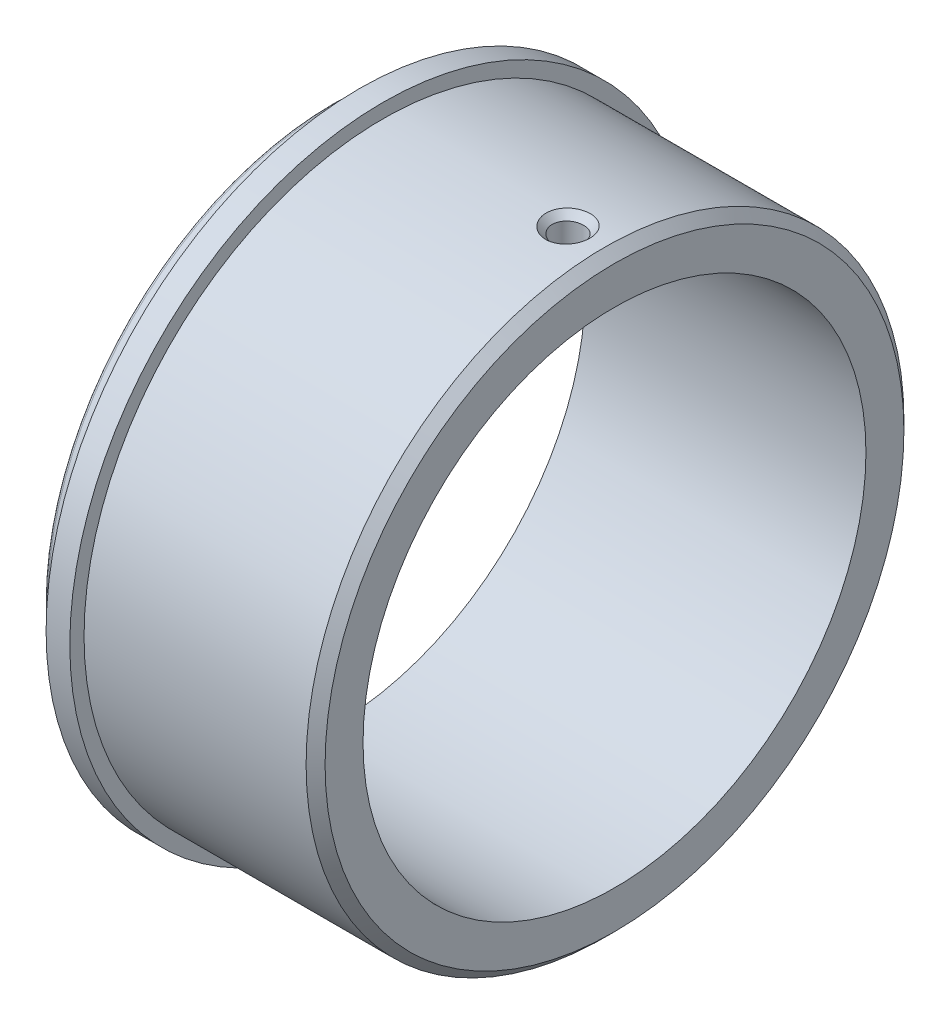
ISO-10303-21;
HEADER;
FILE_DESCRIPTION(('STEP AP214'),'2;1');
FILE_NAME('part.step','',(''),(''),'','','');
FILE_SCHEMA(('AUTOMOTIVE_DESIGN { 1 0 10303 214 1 1 1 1 }'));
ENDSEC;
DATA;
#1=APPLICATION_CONTEXT('core data for automotive mechanical design processes');
#2=APPLICATION_PROTOCOL_DEFINITION('international standard','automotive_design',2000,#1);
#3=PRODUCT_CONTEXT('',#1,'mechanical');
#4=PRODUCT('Part','Part','',(#3));
#5=PRODUCT_RELATED_PRODUCT_CATEGORY('part','',(#4));
#6=PRODUCT_DEFINITION_FORMATION('','',#4);
#7=PRODUCT_DEFINITION_CONTEXT('part definition',#1,'design');
#8=PRODUCT_DEFINITION('design','',#6,#7);
#9=PRODUCT_DEFINITION_SHAPE('','',#8);
#10=(LENGTH_UNIT() NAMED_UNIT(*) SI_UNIT(.MILLI.,.METRE.));
#11=(NAMED_UNIT(*) PLANE_ANGLE_UNIT() SI_UNIT($,.RADIAN.));
#12=(NAMED_UNIT(*) SI_UNIT($,.STERADIAN.) SOLID_ANGLE_UNIT());
#13=UNCERTAINTY_MEASURE_WITH_UNIT(LENGTH_MEASURE(1.E-05),#10,'distance_accuracy_value','');
#14=(GEOMETRIC_REPRESENTATION_CONTEXT(3) GLOBAL_UNCERTAINTY_ASSIGNED_CONTEXT((#13)) GLOBAL_UNIT_ASSIGNED_CONTEXT((#10,
#11,#12)) REPRESENTATION_CONTEXT('',''));
#15=CARTESIAN_POINT('',(0.,0.,0.));
#16=DIRECTION('',(0.,0.,1.));
#17=DIRECTION('',(1.,0.,0.));
#18=AXIS2_PLACEMENT_3D('',#15,#16,#17);
#19=CARTESIAN_POINT('',(0.400000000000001,26.5,0.));
#20=DIRECTION('',(1.,0.,0.));
#21=DIRECTION('',(0.,0.,-1.));
#22=AXIS2_PLACEMENT_3D('',#19,#20,#21);
#23=PLANE('',#22);
#24=CARTESIAN_POINT('',(0.400000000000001,0.,0.));
#25=DIRECTION('',(-1.,0.,0.));
#26=DIRECTION('',(0.,0.,1.));
#27=AXIS2_PLACEMENT_3D('',#24,#25,#26);
#28=CIRCLE('',#27,26.5);
#29=CARTESIAN_POINT('',(0.400000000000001,0.,26.5));
#30=VERTEX_POINT('',#29);
#31=EDGE_CURVE('E397',#30,#30,#28,.T.);
#32=ORIENTED_EDGE('',*,*,#31,.F.);
#33=EDGE_LOOP('',(#32));
#34=FACE_BOUND('',#33,.T.);
#35=CARTESIAN_POINT('',(0.400000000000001,0.,0.));
#36=DIRECTION('',(-1.,0.,0.));
#37=DIRECTION('',(0.,0.,1.));
#38=AXIS2_PLACEMENT_3D('',#35,#36,#37);
#39=CIRCLE('',#38,30.1948685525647);
#40=CARTESIAN_POINT('',(0.400000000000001,0.,30.1948685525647));
#41=VERTEX_POINT('',#40);
#42=EDGE_CURVE('E370',#41,#41,#39,.T.);
#43=ORIENTED_EDGE('',*,*,#42,.T.);
#44=EDGE_LOOP('',(#43));
#45=FACE_BOUND('',#44,.T.);
#46=ADVANCED_FACE('F292',(#34,#45),#23,.F.);
#47=CARTESIAN_POINT('',(0.,0.,0.));
#48=DIRECTION('',(-1.,0.,0.));
#49=DIRECTION('',(0.,0.,1.));
#50=AXIS2_PLACEMENT_3D('',#47,#48,#49);
#51=CYLINDRICAL_SURFACE('',#50,26.5);
#52=CARTESIAN_POINT('',(25.1,26.4485821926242,1.64999999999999));
#53=CARTESIAN_POINT('',(25.1925847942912,26.4485828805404,1.64999592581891));
#54=CARTESIAN_POINT('',(25.2852344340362,26.4490735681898,1.64218113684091));
#55=CARTESIAN_POINT('',(25.4679754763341,26.4509835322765,1.61111854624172));
#56=CARTESIAN_POINT('',(25.5580637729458,26.4524038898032,1.58785277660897));
#57=CARTESIAN_POINT('',(25.7330086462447,26.4560116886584,1.52655904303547));
#58=CARTESIAN_POINT('',(25.8178679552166,26.4581987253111,1.48853886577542));
#59=CARTESIAN_POINT('',(25.9799780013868,26.463092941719,1.39882815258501));
#60=CARTESIAN_POINT('',(26.0572304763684,26.4658000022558,1.34714074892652));
#61=CARTESIAN_POINT('',(26.2020714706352,26.4714338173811,1.2314781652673));
#62=CARTESIAN_POINT('',(26.2696471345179,26.4743608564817,1.1674868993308));
#63=CARTESIAN_POINT('',(26.3931062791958,26.4801021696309,1.02906622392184));
#64=CARTESIAN_POINT('',(26.4489892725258,26.4829164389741,0.954636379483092));
#65=CARTESIAN_POINT('',(26.5475159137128,26.4881175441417,0.797379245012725));
#66=CARTESIAN_POINT('',(26.5901489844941,26.4905040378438,0.714545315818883));
#67=CARTESIAN_POINT('',(26.6608978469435,26.4945777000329,0.542877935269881));
#68=CARTESIAN_POINT('',(26.6890137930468,26.4962648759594,0.454044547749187));
#69=CARTESIAN_POINT('',(26.729894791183,26.4987478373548,0.273023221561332));
#70=CARTESIAN_POINT('',(26.7426798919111,26.4995447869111,0.18083982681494));
#71=CARTESIAN_POINT('',(26.7525981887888,26.5001614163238,-0.00436781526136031));
#72=CARTESIAN_POINT('',(26.7497315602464,26.499981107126,-0.0973920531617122));
#73=CARTESIAN_POINT('',(26.7284443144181,26.4986645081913,-0.281504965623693));
#74=CARTESIAN_POINT('',(26.7100452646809,26.4975295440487,-0.372596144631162));
#75=CARTESIAN_POINT('',(26.658248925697,26.4944329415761,-0.550394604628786));
#76=CARTESIAN_POINT('',(26.6248515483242,26.4924712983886,-0.637101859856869));
#77=CARTESIAN_POINT('',(26.5439821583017,26.4879399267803,-0.803740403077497));
#78=CARTESIAN_POINT('',(26.4965003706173,26.4853697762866,-0.883666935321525));
#79=CARTESIAN_POINT('',(26.3888171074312,26.4799106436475,-1.03442327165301));
#80=CARTESIAN_POINT('',(26.3286154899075,26.4770216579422,-1.10525297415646));
#81=CARTESIAN_POINT('',(26.1970796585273,26.4712442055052,-1.23593093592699));
#82=CARTESIAN_POINT('',(26.1257267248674,26.4683557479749,-1.29576035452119));
#83=CARTESIAN_POINT('',(25.9739792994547,26.4629098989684,-1.40259414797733));
#84=CARTESIAN_POINT('',(25.8935848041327,26.460352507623,-1.44959851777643));
#85=CARTESIAN_POINT('',(25.7260243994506,26.4558575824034,-1.52944658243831));
#86=CARTESIAN_POINT('',(25.6388581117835,26.4539200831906,-1.56228948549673));
#87=CARTESIAN_POINT('',(25.4602339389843,26.4508846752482,-1.61286932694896));
#88=CARTESIAN_POINT('',(25.3687761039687,26.4497867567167,-1.63060644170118));
#89=CARTESIAN_POINT('',(25.1843293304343,26.4485561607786,-1.65044774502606));
#90=CARTESIAN_POINT('',(25.0913432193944,26.4484218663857,-1.65257812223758));
#91=CARTESIAN_POINT('',(24.9063349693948,26.4491294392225,-1.64121389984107));
#92=CARTESIAN_POINT('',(24.81431282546,26.4499713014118,-1.62771938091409));
#93=CARTESIAN_POINT('',(24.6339187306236,26.4525348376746,-1.58551018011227));
#94=CARTESIAN_POINT('',(24.5455439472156,26.4542558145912,-1.55680755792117));
#95=CARTESIAN_POINT('',(24.3748657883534,26.4583830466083,-1.48500912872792));
#96=CARTESIAN_POINT('',(24.2925624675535,26.4607893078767,-1.44191319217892));
#97=CARTESIAN_POINT('',(24.1362432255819,26.4660198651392,-1.3424845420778));
#98=CARTESIAN_POINT('',(24.0622384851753,26.4688447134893,-1.2861342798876));
#99=CARTESIAN_POINT('',(23.9247297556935,26.4745921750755,-1.16182209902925));
#100=CARTESIAN_POINT('',(23.8612258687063,26.4775147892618,-1.09386006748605));
#101=CARTESIAN_POINT('',(23.7464330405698,26.4831331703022,-0.948140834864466));
#102=CARTESIAN_POINT('',(23.6951610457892,26.4858286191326,-0.870370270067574));
#103=CARTESIAN_POINT('',(23.6064033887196,26.4906843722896,-0.707308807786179));
#104=CARTESIAN_POINT('',(23.5689176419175,26.4928446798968,-0.622017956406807));
#105=CARTESIAN_POINT('',(23.508826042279,26.4963852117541,-0.44639933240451));
#106=CARTESIAN_POINT('',(23.4862094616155,26.4977659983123,-0.356075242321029));
#107=CARTESIAN_POINT('',(23.4564630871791,26.4995941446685,-0.172902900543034));
#108=CARTESIAN_POINT('',(23.4493331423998,26.5000415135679,-0.0800546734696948));
#109=CARTESIAN_POINT('',(23.4507638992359,26.4999524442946,0.105362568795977));
#110=CARTESIAN_POINT('',(23.4592980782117,26.4994176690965,0.197931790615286));
#111=CARTESIAN_POINT('',(23.4917598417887,26.4974277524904,0.380320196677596));
#112=CARTESIAN_POINT('',(23.5156874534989,26.4959726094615,0.47013937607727));
#113=CARTESIAN_POINT('',(23.5782508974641,26.4923055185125,0.644482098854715));
#114=CARTESIAN_POINT('',(23.6168866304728,26.490093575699,0.729005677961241));
#115=CARTESIAN_POINT('',(23.7077658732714,26.4851612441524,0.890369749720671));
#116=CARTESIAN_POINT('',(23.7600090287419,26.4824408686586,0.967210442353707));
#117=CARTESIAN_POINT('',(23.8767180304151,26.4767922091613,1.11116196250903));
#118=CARTESIAN_POINT('',(23.9412030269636,26.4738636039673,1.17825725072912));
#119=CARTESIAN_POINT('',(24.0805399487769,26.4681311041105,1.30069340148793));
#120=CARTESIAN_POINT('',(24.1553944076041,26.4653272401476,1.35603138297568));
#121=CARTESIAN_POINT('',(24.3134304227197,26.4601578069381,1.45342275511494));
#122=CARTESIAN_POINT('',(24.3966221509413,26.4577927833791,1.49545965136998));
#123=CARTESIAN_POINT('',(24.5688369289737,26.4537758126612,1.56491757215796));
#124=CARTESIAN_POINT('',(24.6578530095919,26.4521230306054,1.59235571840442));
#125=CARTESIAN_POINT('',(24.8061782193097,26.4501509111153,1.62470446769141));
#126=CARTESIAN_POINT('',(24.8645285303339,26.4495652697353,1.63417802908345));
#127=CARTESIAN_POINT('',(24.9819104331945,26.4487806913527,1.64682709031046));
#128=CARTESIAN_POINT('',(25.0409420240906,26.4485817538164,1.65000259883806));
#129=CARTESIAN_POINT('',(25.1,26.4485821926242,1.64999999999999));
#130=B_SPLINE_CURVE_WITH_KNOTS('',3,(#52,#53,#54,#55,#56,#57,#58,#59,#60,#61,#62,#63,#64,#65,
#66,#67,#68,#69,#70,#71,#72,#73,#74,#75,#76,#77,#78,#79,#80,#81,#82,#83,#84,#85,#86,#87,#88,#89,
#90,#91,#92,#93,#94,#95,#96,#97,#98,#99,#100,#101,#102,#103,#104,#105,#106,#107,#108,#109,#110,
#111,#112,#113,#114,#115,#116,#117,#118,#119,#120,#121,#122,#123,#124,#125,#126,#127,#128,#129),
.UNSPECIFIED.,.T.,.F.,(4,2,2,2,2,2,2,2,2,2,2,2,2,2,2,2,2,2,2,2,2,2,2,2,2,2,2,2,2,2,2,2,2,2,2,2,
2,2,4),(0.,0.277538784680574,0.555400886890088,0.833116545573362,1.11076861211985,
1.38878617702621,1.66681533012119,1.94506586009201,2.22331342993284,2.50119672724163,
2.77907691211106,3.05657187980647,3.33406847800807,3.61175812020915,3.88945086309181,
4.16761487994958,4.44577900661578,4.72395868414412,5.00213511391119,5.27984464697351,
5.55755274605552,5.83504095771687,6.1125316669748,6.39039186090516,6.66825475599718,
6.94650040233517,7.22474434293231,7.50278731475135,7.78082757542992,8.0583974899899,
8.33596789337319,8.61353642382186,8.89109772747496,9.16909686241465,9.44716404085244,
9.72557470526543,10.0036581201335,10.1806947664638,10.3577311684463),.UNSPECIFIED.);
#131=CARTESIAN_POINT('',(25.1,26.4485821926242,1.64999999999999));
#132=VERTEX_POINT('',#131);
#133=EDGE_CURVE('E365',#132,#132,#130,.T.);
#134=ORIENTED_EDGE('',*,*,#133,.T.);
#135=EDGE_LOOP('',(#134));
#136=FACE_BOUND('',#135,.T.);
#137=CARTESIAN_POINT('',(30.,0.,0.));
#138=DIRECTION('',(-1.,0.,0.));
#139=DIRECTION('',(0.,0.,1.));
#140=AXIS2_PLACEMENT_3D('',#137,#138,#139);
#141=CIRCLE('',#140,26.5);
#142=CARTESIAN_POINT('',(30.,0.,26.5));
#143=VERTEX_POINT('',#142);
#144=EDGE_CURVE('E394',#143,#143,#141,.T.);
#145=ORIENTED_EDGE('',*,*,#144,.F.);
#146=EDGE_LOOP('',(#145));
#147=FACE_BOUND('',#146,.T.);
#148=ORIENTED_EDGE('',*,*,#31,.T.);
#149=EDGE_LOOP('',(#148));
#150=FACE_BOUND('',#149,.T.);
#151=ADVANCED_FACE('F418',(#136,#147,#150),#51,.F.);
#152=CARTESIAN_POINT('',(30.,26.5,0.));
#153=DIRECTION('',(-1.,0.,0.));
#154=DIRECTION('',(0.,0.,1.));
#155=AXIS2_PLACEMENT_3D('',#152,#153,#154);
#156=PLANE('',#155);
#157=CARTESIAN_POINT('',(30.,0.,0.));
#158=DIRECTION('',(-1.,0.,0.));
#159=DIRECTION('',(0.,0.,1.));
#160=AXIS2_PLACEMENT_3D('',#157,#158,#159);
#161=CIRCLE('',#160,30.5);
#162=CARTESIAN_POINT('',(30.,0.,30.5));
#163=VERTEX_POINT('',#162);
#164=EDGE_CURVE('E11',#163,#163,#161,.F.);
#165=ORIENTED_EDGE('',*,*,#164,.T.);
#166=EDGE_LOOP('',(#165));
#167=FACE_BOUND('',#166,.T.);
#168=ORIENTED_EDGE('',*,*,#144,.T.);
#169=EDGE_LOOP('',(#168));
#170=FACE_BOUND('',#169,.T.);
#171=ADVANCED_FACE('F415',(#167,#170),#156,.F.);
#172=CARTESIAN_POINT('',(0.,0.,0.));
#173=DIRECTION('',(-1.,0.,0.));
#174=DIRECTION('',(0.,0.,1.));
#175=AXIS2_PLACEMENT_3D('',#172,#173,#174);
#176=CYLINDRICAL_SURFACE('',#175,31.5);
#177=CARTESIAN_POINT('',(29.,0.,0.));
#178=DIRECTION('',(-1.,0.,0.));
#179=DIRECTION('',(0.,0.,1.));
#180=AXIS2_PLACEMENT_3D('',#177,#178,#179);
#181=CIRCLE('',#180,31.5);
#182=CARTESIAN_POINT('',(29.,0.,31.5));
#183=VERTEX_POINT('',#182);
#184=EDGE_CURVE('E299',#183,#183,#181,.T.);
#185=ORIENTED_EDGE('',*,*,#184,.T.);
#186=EDGE_LOOP('',(#185));
#187=FACE_BOUND('',#186,.T.);
#188=CARTESIAN_POINT('',(25.1,31.4118383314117,2.35508230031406));
#189=CARTESIAN_POINT('',(25.1376884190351,31.4118369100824,2.35510479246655));
#190=CARTESIAN_POINT('',(25.1753758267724,31.4119158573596,2.35413760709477));
#191=CARTESIAN_POINT('',(25.2506224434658,31.4122259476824,2.35025734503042));
#192=CARTESIAN_POINT('',(25.2881817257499,31.4124569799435,2.34734568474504));
#193=CARTESIAN_POINT('',(25.3630907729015,31.4130626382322,2.3396109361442));
#194=CARTESIAN_POINT('',(25.40044059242,31.4134372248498,2.33478837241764));
#195=CARTESIAN_POINT('',(25.4748506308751,31.4143213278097,2.32326705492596));
#196=CARTESIAN_POINT('',(25.5119108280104,31.4148308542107,2.31656816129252));
#197=CARTESIAN_POINT('',(25.5856612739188,31.415976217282,2.30132891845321));
#198=CARTESIAN_POINT('',(25.6223513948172,31.4166120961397,2.29278795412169));
#199=CARTESIAN_POINT('',(25.6952814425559,31.4180015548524,2.27389919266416));
#200=CARTESIAN_POINT('',(25.7315211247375,31.4187551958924,2.26355045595));
#201=CARTESIAN_POINT('',(25.8034700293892,31.4203715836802,2.24108060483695));
#202=CARTESIAN_POINT('',(25.8391788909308,31.4212344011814,2.22895834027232));
#203=CARTESIAN_POINT('',(25.9099858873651,31.423060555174,2.20297578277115));
#204=CARTESIAN_POINT('',(25.9450835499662,31.4240239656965,2.18911420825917));
#205=CARTESIAN_POINT('',(26.014587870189,31.4260427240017,2.15968730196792));
#206=CARTESIAN_POINT('',(26.0489939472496,31.427098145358,2.1441206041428));
#207=CARTESIAN_POINT('',(26.1170348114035,31.4292923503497,2.11131767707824));
#208=CARTESIAN_POINT('',(26.1506689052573,31.4304312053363,2.09408001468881));
#209=CARTESIAN_POINT('',(26.2170855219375,31.4327836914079,2.05796936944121));
#210=CARTESIAN_POINT('',(26.2498672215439,31.433997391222,2.03909487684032));
#211=CARTESIAN_POINT('',(26.3144987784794,31.4364910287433,1.99974478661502));
#212=CARTESIAN_POINT('',(26.3463476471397,31.4377710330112,1.97926756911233));
#213=CARTESIAN_POINT('',(26.4090333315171,31.4403885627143,1.93674629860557));
#214=CARTESIAN_POINT('',(26.4398689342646,31.4417261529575,1.9147004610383));
#215=CARTESIAN_POINT('',(26.5004478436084,31.4444508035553,1.86907619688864));
#216=CARTESIAN_POINT('',(26.5301896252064,31.4458379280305,1.8454957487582));
#217=CARTESIAN_POINT('',(26.5885010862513,31.4486511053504,1.79683686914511));
#218=CARTESIAN_POINT('',(26.6170688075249,31.450077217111,1.77175609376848));
#219=CARTESIAN_POINT('',(26.6729511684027,31.4529671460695,1.72013017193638));
#220=CARTESIAN_POINT('',(26.7002632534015,31.4544310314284,1.69358226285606));
#221=CARTESIAN_POINT('',(26.7535283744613,31.4573587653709,1.63909051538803));
#222=CARTESIAN_POINT('',(26.7794796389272,31.4588226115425,1.61114494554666));
#223=CARTESIAN_POINT('',(26.8299607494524,31.4617125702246,1.55397060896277));
#224=CARTESIAN_POINT('',(26.8544898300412,31.4631386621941,1.52474116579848));
#225=CARTESIAN_POINT('',(26.9020915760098,31.4659519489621,1.46508066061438));
#226=CARTESIAN_POINT('',(26.9251630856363,31.4673391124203,1.43464867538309));
#227=CARTESIAN_POINT('',(26.9698158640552,31.4700640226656,1.37266550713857));
#228=CARTESIAN_POINT('',(26.9913957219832,31.4714017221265,1.34111330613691));
#229=CARTESIAN_POINT('',(27.0330308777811,31.4740196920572,1.27697171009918));
#230=CARTESIAN_POINT('',(27.0530846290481,31.4752999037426,1.24438130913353));
#231=CARTESIAN_POINT('',(27.0916332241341,31.4777942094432,1.17824529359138));
#232=CARTESIAN_POINT('',(27.1101264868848,31.4790082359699,1.14469875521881));
#233=CARTESIAN_POINT('',(27.1455196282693,31.4813616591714,1.07673236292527));
#234=CARTESIAN_POINT('',(27.1624179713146,31.4825009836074,1.04231170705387));
#235=CARTESIAN_POINT('',(27.1945867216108,31.484696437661,0.972678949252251));
#236=CARTESIAN_POINT('',(27.2098556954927,31.4857524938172,0.937466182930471));
#237=CARTESIAN_POINT('',(27.2387310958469,31.4877728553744,0.866331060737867));
#238=CARTESIAN_POINT('',(27.2523362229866,31.4887370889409,0.830408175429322));
#239=CARTESIAN_POINT('',(27.2778492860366,31.4905652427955,0.757934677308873));
#240=CARTESIAN_POINT('',(27.2897560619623,31.4914290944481,0.72138365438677));
#241=CARTESIAN_POINT('',(27.3118377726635,31.4930479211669,0.647735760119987));
#242=CARTESIAN_POINT('',(27.3220116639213,31.4938028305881,0.610638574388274));
#243=CARTESIAN_POINT('',(27.3405929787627,31.4951952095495,0.535980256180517));
#244=CARTESIAN_POINT('',(27.3489994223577,31.4958326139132,0.498418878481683));
#245=CARTESIAN_POINT('',(27.3640112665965,31.4969814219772,0.422914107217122));
#246=CARTESIAN_POINT('',(27.3706156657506,31.4974927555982,0.384970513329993));
#247=CARTESIAN_POINT('',(27.3819889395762,31.4983808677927,0.308783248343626));
#248=CARTESIAN_POINT('',(27.3867566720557,31.498757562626,0.270539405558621));
#249=CARTESIAN_POINT('',(27.3944222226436,31.4993678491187,0.193833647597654));
#250=CARTESIAN_POINT('',(27.3973186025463,31.4996013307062,0.155371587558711));
#251=CARTESIAN_POINT('',(27.4012073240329,31.49991666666,0.0783111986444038));
#252=CARTESIAN_POINT('',(27.4021977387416,31.4999983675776,0.0397127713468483));
#253=CARTESIAN_POINT('',(27.4022401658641,31.5000015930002,-0.0374842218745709));
#254=CARTESIAN_POINT('',(27.40129222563,31.4999231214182,-0.0760827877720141));
#255=CARTESIAN_POINT('',(27.397487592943,31.4996141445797,-0.153143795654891));
#256=CARTESIAN_POINT('',(27.3946329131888,31.4993837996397,-0.19160633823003));
#257=CARTESIAN_POINT('',(27.3870500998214,31.4987796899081,-0.268313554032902));
#258=CARTESIAN_POINT('',(27.3823234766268,31.4984060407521,-0.30655837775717));
#259=CARTESIAN_POINT('',(27.3710317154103,31.497523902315,-0.382748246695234));
#260=CARTESIAN_POINT('',(27.364467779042,31.4970155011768,-0.420693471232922));
#261=CARTESIAN_POINT('',(27.3495361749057,31.4958724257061,-0.496202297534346));
#262=CARTESIAN_POINT('',(27.3411695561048,31.4952378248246,-0.53376610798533));
#263=CARTESIAN_POINT('',(27.3226672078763,31.493850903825,-0.608430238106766));
#264=CARTESIAN_POINT('',(27.3125324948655,31.4930986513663,-0.645530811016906));
#265=CARTESIAN_POINT('',(27.2905284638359,31.4914849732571,-0.71918657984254));
#266=CARTESIAN_POINT('',(27.2786602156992,31.4906236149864,-0.755742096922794));
#267=CARTESIAN_POINT('',(27.2532235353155,31.4888002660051,-0.828225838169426));
#268=CARTESIAN_POINT('',(27.2396562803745,31.4878383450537,-0.864154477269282));
#269=CARTESIAN_POINT('',(27.2108559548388,31.4858224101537,-0.935302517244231));
#270=CARTESIAN_POINT('',(27.1956241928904,31.4847684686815,-0.970522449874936));
#271=CARTESIAN_POINT('',(27.1635291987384,31.4825770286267,-1.04017110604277));
#272=CARTESIAN_POINT('',(27.1466674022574,31.4814396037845,-1.07460049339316));
#273=CARTESIAN_POINT('',(27.1113466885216,31.4790897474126,-1.14258607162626));
#274=CARTESIAN_POINT('',(27.0928893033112,31.477877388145,-1.17614306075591));
#275=CARTESIAN_POINT('',(27.0544117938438,31.4753861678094,-1.24230185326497));
#276=CARTESIAN_POINT('',(27.0343932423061,31.4741073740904,-1.27490457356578));
#277=CARTESIAN_POINT('',(26.9928278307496,31.4714919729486,-1.33907285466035));
#278=CARTESIAN_POINT('',(26.9712825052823,31.470155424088,-1.37063941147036));
#279=CARTESIAN_POINT('',(26.9266980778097,31.4674325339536,-1.43265343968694));
#280=CARTESIAN_POINT('',(26.9036603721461,31.4660462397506,-1.46310191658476));
#281=CARTESIAN_POINT('',(26.8561257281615,31.463234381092,-1.52279791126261));
#282=CARTESIAN_POINT('',(26.8316299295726,31.4618088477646,-1.55204633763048));
#283=CARTESIAN_POINT('',(26.781214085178,31.4589197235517,-1.60926054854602));
#284=CARTESIAN_POINT('',(26.7552947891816,31.4574561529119,-1.6372269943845));
#285=CARTESIAN_POINT('',(26.7020961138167,31.4545285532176,-1.69176440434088));
#286=CARTESIAN_POINT('',(26.6748185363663,31.4530645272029,-1.71833712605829));
#287=CARTESIAN_POINT('',(26.6190098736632,31.4501738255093,-1.77001780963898));
#288=CARTESIAN_POINT('',(26.5904814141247,31.4487470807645,-1.79512860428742));
#289=CARTESIAN_POINT('',(26.5322509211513,31.4459322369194,-1.84385127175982));
#290=CARTESIAN_POINT('',(26.5025509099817,31.4445440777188,-1.86746555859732));
#291=CARTESIAN_POINT('',(26.4420567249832,31.441816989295,-1.91316085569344));
#292=CARTESIAN_POINT('',(26.4112641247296,31.4404779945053,-1.93524394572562));
#293=CARTESIAN_POINT('',(26.3486641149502,31.4378573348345,-1.97784243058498));
#294=CARTESIAN_POINT('',(26.3168579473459,31.4365756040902,-1.9983596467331));
#295=CARTESIAN_POINT('',(26.2523100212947,31.4340782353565,-2.03779187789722));
#296=CARTESIAN_POINT('',(26.2195692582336,31.4328625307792,-2.05670851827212));
#297=CARTESIAN_POINT('',(26.1532312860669,31.4305057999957,-2.09290502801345));
#298=CARTESIAN_POINT('',(26.1196348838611,31.4293647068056,-2.1101863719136));
#299=CARTESIAN_POINT('',(26.0516647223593,31.4271658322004,-2.1430776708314));
#300=CARTESIAN_POINT('',(26.0172916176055,31.4261079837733,-2.15868897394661));
#301=CARTESIAN_POINT('',(25.9478471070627,31.4240842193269,-2.18820554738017));
#302=CARTESIAN_POINT('',(25.9127762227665,31.4231182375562,-2.20211203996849));
#303=CARTESIAN_POINT('',(25.8420151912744,31.4212868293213,-2.22818434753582));
#304=CARTESIAN_POINT('',(25.8063254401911,31.4204213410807,-2.24035123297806));
#305=CARTESIAN_POINT('',(25.7344057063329,31.4187995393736,-2.26290970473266));
#306=CARTESIAN_POINT('',(25.6981759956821,31.4180431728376,-2.27330215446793));
#307=CARTESIAN_POINT('',(25.6252553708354,31.4166482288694,-2.2922771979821));
#308=CARTESIAN_POINT('',(25.5885646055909,31.4160096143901,-2.30086036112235));
#309=CARTESIAN_POINT('',(25.5148009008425,31.4148587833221,-2.31618232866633));
#310=CARTESIAN_POINT('',(25.4777279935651,31.4143465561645,-2.32292128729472));
#311=CARTESIAN_POINT('',(25.4032790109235,31.4134570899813,-2.33452059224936));
#312=CARTESIAN_POINT('',(25.36590287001,31.4130798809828,-2.33938052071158));
#313=CARTESIAN_POINT('',(25.2909264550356,31.4124690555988,-2.34718719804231));
#314=CARTESIAN_POINT('',(25.2533260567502,31.4122355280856,-2.35013276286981));
#315=CARTESIAN_POINT('',(25.1779799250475,31.4119205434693,-2.35407810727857));
#316=CARTESIAN_POINT('',(25.1402340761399,31.4118392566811,-2.35507570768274));
#317=CARTESIAN_POINT('',(25.064724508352,31.4118376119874,-2.35508614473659));
#318=CARTESIAN_POINT('',(25.0269607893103,31.411917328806,-2.35409805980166));
#319=CARTESIAN_POINT('',(24.9515464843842,31.4122296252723,-2.35016430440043));
#320=CARTESIAN_POINT('',(24.9138958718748,31.4124621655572,-2.34721913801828));
#321=CARTESIAN_POINT('',(24.8387910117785,31.4130712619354,-2.33940969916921));
#322=CARTESIAN_POINT('',(24.8013367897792,31.4134478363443,-2.33454518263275));
#323=CARTESIAN_POINT('',(24.7267081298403,31.4143362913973,-2.32293344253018));
#324=CARTESIAN_POINT('',(24.689533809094,31.4148482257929,-2.31618547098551));
#325=CARTESIAN_POINT('',(24.6155482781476,31.4159986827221,-2.30084346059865));
#326=CARTESIAN_POINT('',(24.5787372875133,31.4166372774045,-2.2922483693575));
#327=CARTESIAN_POINT('',(24.5055617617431,31.4180323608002,-2.27324843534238));
#328=CARTESIAN_POINT('',(24.469197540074,31.4187889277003,-2.26284239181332));
#329=CARTESIAN_POINT('',(24.3969989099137,31.4204112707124,-2.24025675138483));
#330=CARTESIAN_POINT('',(24.361164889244,31.4212771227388,-2.22807592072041));
#331=CARTESIAN_POINT('',(24.2901100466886,31.4231093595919,-2.20197678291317));
#332=CARTESIAN_POINT('',(24.2548896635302,31.424075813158,-2.18805728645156));
#333=CARTESIAN_POINT('',(24.1851455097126,31.4261005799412,-2.15851682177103));
#334=CARTESIAN_POINT('',(24.1506222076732,31.4271589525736,-2.1428947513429));
#335=CARTESIAN_POINT('',(24.0823556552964,31.4293588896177,-2.10998510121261));
#336=CARTESIAN_POINT('',(24.0486128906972,31.4305005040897,-2.09269651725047));
#337=CARTESIAN_POINT('',(23.9819908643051,31.4328582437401,-2.05648979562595));
#338=CARTESIAN_POINT('',(23.9491121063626,31.4340744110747,-2.03757073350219));
#339=CARTESIAN_POINT('',(23.884301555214,31.4365726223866,-1.99813901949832));
#340=CARTESIAN_POINT('',(23.8523703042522,31.4378547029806,-1.97762547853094));
#341=CARTESIAN_POINT('',(23.7895381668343,31.4404759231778,-1.93504085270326));
#342=CARTESIAN_POINT('',(23.7586379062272,31.441815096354,-1.91296884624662));
#343=CARTESIAN_POINT('',(23.6979512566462,31.4445423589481,-1.86730326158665));
#344=CARTESIAN_POINT('',(23.6681656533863,31.4459304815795,-1.84370864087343));
#345=CARTESIAN_POINT('',(23.6097911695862,31.4487449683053,-1.79503441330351));
#346=CARTESIAN_POINT('',(23.5812033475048,31.4501713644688,-1.76995353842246));
#347=CARTESIAN_POINT('',(23.5253093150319,31.4530611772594,-1.71834152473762));
#348=CARTESIAN_POINT('',(23.498004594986,31.4545246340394,-1.69180877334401));
#349=CARTESIAN_POINT('',(23.4447714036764,31.4574510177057,-1.63735357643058));
#350=CARTESIAN_POINT('',(23.4188441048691,31.4589139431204,-1.60942998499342));
#351=CARTESIAN_POINT('',(23.3684128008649,31.46180184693,-1.55229829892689));
#352=CARTESIAN_POINT('',(23.343909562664,31.463226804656,-1.52308952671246));
#353=CARTESIAN_POINT('',(23.2963618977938,31.4660377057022,-1.46346877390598));
#354=CARTESIAN_POINT('',(23.2733186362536,31.4674236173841,-1.43305586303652));
#355=CARTESIAN_POINT('',(23.2287243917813,31.4701458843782,-1.3711098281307));
#356=CARTESIAN_POINT('',(23.2071748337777,31.4714821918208,-1.33957567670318));
#357=CARTESIAN_POINT('',(23.1656021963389,31.4740972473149,-1.27546950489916));
#358=CARTESIAN_POINT('',(23.1455806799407,31.4753759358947,-1.24289646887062));
#359=CARTESIAN_POINT('',(23.1070982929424,31.4778670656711,-1.17679490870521));
#360=CARTESIAN_POINT('',(23.0886390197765,31.479079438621,-1.14326545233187));
#361=CARTESIAN_POINT('',(23.0533154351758,31.4814294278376,-1.07533333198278));
#362=CARTESIAN_POINT('',(23.0364526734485,31.4825669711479,-1.04092985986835));
#363=CARTESIAN_POINT('',(23.0043565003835,31.4847587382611,-0.971331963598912));
#364=CARTESIAN_POINT('',(22.9891245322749,31.4858128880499,-0.936136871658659));
#365=CARTESIAN_POINT('',(22.9603243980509,31.4878293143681,-0.865037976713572));
#366=CARTESIAN_POINT('',(22.9467575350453,31.4887915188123,-0.829133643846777));
#367=CARTESIAN_POINT('',(22.9213220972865,31.4906154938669,-0.756698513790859));
#368=CARTESIAN_POINT('',(22.9094546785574,31.4914771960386,-0.720167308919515));
#369=CARTESIAN_POINT('',(22.8874526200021,31.4930916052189,-0.646560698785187));
#370=CARTESIAN_POINT('',(22.8773190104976,31.4938442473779,-0.609484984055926));
#371=CARTESIAN_POINT('',(22.8588190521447,31.4952319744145,-0.534871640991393));
#372=CARTESIAN_POINT('',(22.8504536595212,31.4958669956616,-0.497333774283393));
#373=CARTESIAN_POINT('',(22.8355245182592,31.4970109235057,-0.4218784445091));
#374=CARTESIAN_POINT('',(22.828961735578,31.4975197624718,-0.383960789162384));
#375=CARTESIAN_POINT('',(22.8176722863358,31.4984027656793,-0.307828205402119));
#376=CARTESIAN_POINT('',(22.8129467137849,31.4987768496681,-0.269613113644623));
#377=CARTESIAN_POINT('',(22.8053653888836,31.4993818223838,-0.192968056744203));
#378=CARTESIAN_POINT('',(22.8025110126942,31.4996126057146,-0.154537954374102));
#379=CARTESIAN_POINT('',(22.7987080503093,31.499922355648,-0.0775450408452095));
#380=CARTESIAN_POINT('',(22.7977613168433,31.5000011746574,-0.0389821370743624));
#381=CARTESIAN_POINT('',(22.7978003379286,31.4999988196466,0.0381458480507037));
#382=CARTESIAN_POINT('',(22.7987862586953,31.499917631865,0.0767109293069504));
#383=CARTESIAN_POINT('',(22.8026544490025,31.4996037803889,0.153712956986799));
#384=CARTESIAN_POINT('',(22.8055351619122,31.4993712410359,0.192149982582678));
#385=CARTESIAN_POINT('',(22.8131613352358,31.4987631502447,0.268813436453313));
#386=CARTESIAN_POINT('',(22.8179056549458,31.4983876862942,0.307039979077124));
#387=CARTESIAN_POINT('',(22.8292252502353,31.4975023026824,0.383199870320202));
#388=CARTESIAN_POINT('',(22.8357996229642,31.4969924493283,0.421133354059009));
#389=CARTESIAN_POINT('',(22.8507463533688,31.4958467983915,0.496624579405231));
#390=CARTESIAN_POINT('',(22.8591179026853,31.4952110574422,0.534182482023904));
#391=CARTESIAN_POINT('',(22.877625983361,31.4938221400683,0.608839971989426));
#392=CARTESIAN_POINT('',(22.8877616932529,31.4930690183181,0.645939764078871));
#393=CARTESIAN_POINT('',(22.90976524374,31.4914538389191,0.719598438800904));
#394=CARTESIAN_POINT('',(22.9216321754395,31.4905918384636,0.756157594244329));
#395=CARTESIAN_POINT('',(22.9470653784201,31.4887673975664,0.828652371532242));
#396=CARTESIAN_POINT('',(22.9606306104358,31.4878050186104,0.864588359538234));
#397=CARTESIAN_POINT('',(22.9894276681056,31.4857883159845,0.935754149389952));
#398=CARTESIAN_POINT('',(23.0046583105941,31.4847340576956,0.970984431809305));
#399=CARTESIAN_POINT('',(23.0367534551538,31.4825420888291,1.04065613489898));
#400=CARTESIAN_POINT('',(23.0536166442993,31.4814044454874,1.07509816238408));
#401=CARTESIAN_POINT('',(23.0889441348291,31.4790542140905,1.14311066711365));
#402=CARTESIAN_POINT('',(23.1074070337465,31.4778416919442,1.17668187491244));
#403=CARTESIAN_POINT('',(23.1459011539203,31.475350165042,1.24287005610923));
#404=CARTESIAN_POINT('',(23.1659309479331,31.4740712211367,1.27548786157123));
#405=CARTESIAN_POINT('',(23.2075260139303,31.4714554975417,1.33968657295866));
#406=CARTESIAN_POINT('',(23.2290899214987,31.4701187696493,1.37126836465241));
#407=CARTESIAN_POINT('',(23.2737202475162,31.4673954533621,1.43331245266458));
#408=CARTESIAN_POINT('',(23.2967854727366,31.4660089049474,1.46377560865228));
#409=CARTESIAN_POINT('',(23.34438549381,31.4631964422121,1.52349984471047));
#410=CARTESIAN_POINT('',(23.3689193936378,31.461770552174,1.55276163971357));
#411=CARTESIAN_POINT('',(23.4194231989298,31.4588805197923,1.61000095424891));
#412=CARTESIAN_POINT('',(23.445392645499,31.4574163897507,1.63797887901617));
#413=CARTESIAN_POINT('',(23.4987019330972,31.454487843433,1.69253290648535));
#414=CARTESIAN_POINT('',(23.5260401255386,31.4530234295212,1.71911062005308));
#415=CARTESIAN_POINT('',(23.5819759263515,31.4501324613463,1.77079211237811));
#416=CARTESIAN_POINT('',(23.6105709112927,31.4487058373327,1.79589872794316));
#417=CARTESIAN_POINT('',(23.6689382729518,31.4458916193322,1.84460536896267));
#418=CARTESIAN_POINT('',(23.6987086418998,31.4445039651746,1.86820779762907));
#419=CARTESIAN_POINT('',(23.7593454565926,31.4417782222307,1.9138730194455));
#420=CARTESIAN_POINT('',(23.7902103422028,31.440440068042,1.93593788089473));
#421=CARTESIAN_POINT('',(23.8529548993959,31.4378213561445,1.97849489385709));
#422=CARTESIAN_POINT('',(23.8848333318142,31.4365407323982,1.99898886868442));
#423=CARTESIAN_POINT('',(23.949523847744,31.4340457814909,2.03837091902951));
#424=CARTESIAN_POINT('',(23.9823349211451,31.4328313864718,2.05726064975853));
#425=CARTESIAN_POINT('',(24.048809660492,31.4304774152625,2.09340094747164));
#426=CARTESIAN_POINT('',(24.0824724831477,31.4293377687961,2.11065306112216));
#427=CARTESIAN_POINT('',(24.1505697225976,31.4271418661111,2.14348479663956));
#428=CARTESIAN_POINT('',(24.1850034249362,31.4260855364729,2.15906589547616));
#429=CARTESIAN_POINT('',(24.2545614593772,31.4240648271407,2.18852223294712));
#430=CARTESIAN_POINT('',(24.2896851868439,31.4231003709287,2.20239889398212));
#431=CARTESIAN_POINT('',(24.3605423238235,31.4212719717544,2.22841297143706));
#432=CARTESIAN_POINT('',(24.3962752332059,31.4204079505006,2.24055174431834));
#433=CARTESIAN_POINT('',(24.4682697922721,31.4187889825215,2.26305667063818));
#434=CARTESIAN_POINT('',(24.5045310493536,31.4180339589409,2.27342407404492));
#435=CARTESIAN_POINT('',(24.5775013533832,31.4166415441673,2.29235293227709));
#436=CARTESIAN_POINT('',(24.6142101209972,31.4160040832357,2.30091545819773));
#437=CARTESIAN_POINT('',(24.6879945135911,31.4148553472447,2.31620128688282));
#438=CARTESIAN_POINT('',(24.7250699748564,31.4143440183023,2.32292537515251));
#439=CARTESIAN_POINT('',(24.7995067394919,31.413456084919,2.33450123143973));
#440=CARTESIAN_POINT('',(24.8368679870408,31.4130794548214,2.33935335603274));
#441=CARTESIAN_POINT('',(24.911795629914,31.4124694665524,2.34715207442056));
#442=CARTESIAN_POINT('',(24.9493620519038,31.4122361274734,2.35009841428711));
#443=CARTESIAN_POINT('',(25.024618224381,31.4119211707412,2.35405350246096));
#444=CARTESIAN_POINT('',(25.0623080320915,31.4118396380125,2.35506116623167));
#445=CARTESIAN_POINT('',(25.1,31.4118383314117,2.35508230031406));
#446=B_SPLINE_CURVE_WITH_KNOTS('',3,(#188,#189,#190,#191,#192,#193,#194,#195,#196,#197,#198,
#199,#200,#201,#202,#203,#204,#205,#206,#207,#208,#209,#210,#211,#212,#213,#214,#215,#216,#217,
#218,#219,#220,#221,#222,#223,#224,#225,#226,#227,#228,#229,#230,#231,#232,#233,#234,#235,#236,
#237,#238,#239,#240,#241,#242,#243,#244,#245,#246,#247,#248,#249,#250,#251,#252,#253,#254,#255,
#256,#257,#258,#259,#260,#261,#262,#263,#264,#265,#266,#267,#268,#269,#270,#271,#272,#273,#274,
#275,#276,#277,#278,#279,#280,#281,#282,#283,#284,#285,#286,#287,#288,#289,#290,#291,#292,#293,
#294,#295,#296,#297,#298,#299,#300,#301,#302,#303,#304,#305,#306,#307,#308,#309,#310,#311,#312,
#313,#314,#315,#316,#317,#318,#319,#320,#321,#322,#323,#324,#325,#326,#327,#328,#329,#330,#331,
#332,#333,#334,#335,#336,#337,#338,#339,#340,#341,#342,#343,#344,#345,#346,#347,#348,#349,#350,
#351,#352,#353,#354,#355,#356,#357,#358,#359,#360,#361,#362,#363,#364,#365,#366,#367,#368,#369,
#370,#371,#372,#373,#374,#375,#376,#377,#378,#379,#380,#381,#382,#383,#384,#385,#386,#387,#388,
#389,#390,#391,#392,#393,#394,#395,#396,#397,#398,#399,#400,#401,#402,#403,#404,#405,#406,#407,
#408,#409,#410,#411,#412,#413,#414,#415,#416,#417,#418,#419,#420,#421,#422,#423,#424,#425,#426,
#427,#428,#429,#430,#431,#432,#433,#434,#435,#436,#437,#438,#439,#440,#441,#442,#443,#444,#445),
.UNSPECIFIED.,.F.,.F.,(4,2,2,2,2,2,2,2,2,2,2,2,2,2,2,2,2,2,2,2,2,2,2,2,2,2,2,2,2,2,2,2,2,2,2,2,
2,2,2,2,2,2,2,2,2,2,2,2,2,2,2,2,2,2,2,2,2,2,2,2,2,2,2,2,2,2,2,2,2,2,2,2,2,2,2,2,2,2,2,2,2,2,2,2,
2,2,2,2,2,2,2,2,2,2,2,2,2,2,2,2,2,2,2,2,2,2,2,2,2,2,2,2,2,2,2,2,2,2,2,2,2,2,2,2,2,2,2,2,4),(0.,
0.113049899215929,0.22601753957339,0.338954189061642,0.451899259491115,0.564882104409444,
0.67792384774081,0.791039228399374,0.904238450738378,1.01752903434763,1.13091765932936,
1.24441200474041,1.35802257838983,1.4717645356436,1.58565948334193,1.69973726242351,
1.81403769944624,1.92848342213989,2.04299018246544,2.1575866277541,2.27229002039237,
2.38710815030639,2.50204124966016,2.61708390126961,2.73222693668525,2.84745932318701,
2.96277004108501,3.07814995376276,3.19359367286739,3.30910141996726,3.42468088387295,
3.54034906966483,3.65613413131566,3.77191636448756,3.88757657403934,4.00314365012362,
4.11863531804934,4.2340599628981,4.34941847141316,4.46470608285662,4.57991424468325,
4.69503247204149,4.81005021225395,4.92495871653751,5.03975292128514,5.1544333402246,
5.26900796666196,5.38349418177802,5.49792066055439,5.61219918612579,5.72624835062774,
5.84010859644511,5.95381103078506,6.06737913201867,6.18083048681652,6.29417854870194,
6.40743441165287,6.52060859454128,6.63371283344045,6.74676187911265,6.85977529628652,
6.97277925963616,7.08580833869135,7.19890726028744,7.31213263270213,7.42541056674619,
7.53865933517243,7.65192250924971,7.76523072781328,7.87860367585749,7.99205208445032,
8.10557973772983,8.21918547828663,8.33286520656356,8.4466138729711,8.56042746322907,
8.6743049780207,8.78825040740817,8.90227469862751,9.01639771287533,9.13065016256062,
9.24499835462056,9.35940757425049,9.47390697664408,9.58851414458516,9.7032370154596,
9.81807581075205,9.9330249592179,10.0480750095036,10.1632145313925,10.2784320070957,
10.3937177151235,10.5090656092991,10.624475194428,10.73995339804,10.8555164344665,
10.9711916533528,11.0868768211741,11.2024670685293,11.3179866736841,11.4334493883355,
11.5488602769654,11.6642175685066,11.7795145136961,11.8947412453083,12.0098866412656,
12.1249401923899,12.2398938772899,12.3547440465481,12.4694933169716,12.5841524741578,
12.6987423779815,12.8132958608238,12.927714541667,13.0419047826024,13.1559077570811,
13.2697542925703,13.3834666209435,13.4970601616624,13.6105453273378,13.7239293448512,
13.837218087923,13.9504179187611,14.0635375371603,14.1765898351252,14.2895937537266,
14.4025761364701,14.5155735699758,14.6286341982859),.UNSPECIFIED.);
#447=CARTESIAN_POINT('',(25.1,31.4118383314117,2.35508230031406));
#448=VERTEX_POINT('',#447);
#449=EDGE_CURVE('E307',#448,#448,#446,.F.);
#450=ORIENTED_EDGE('',*,*,#449,.T.);
#451=EDGE_LOOP('',(#450));
#452=FACE_BOUND('',#451,.T.);
#453=CARTESIAN_POINT('',(5.6,0.,0.));
#454=DIRECTION('',(-1.,0.,0.));
#455=DIRECTION('',(0.,0.,1.));
#456=AXIS2_PLACEMENT_3D('',#453,#454,#455);
#457=CIRCLE('',#456,31.5);
#458=CARTESIAN_POINT('',(5.6,0.,31.5));
#459=VERTEX_POINT('',#458);
#460=EDGE_CURVE('E391',#459,#459,#457,.T.);
#461=ORIENTED_EDGE('',*,*,#460,.F.);
#462=EDGE_LOOP('',(#461));
#463=FACE_BOUND('',#462,.T.);
#464=ADVANCED_FACE('F404',(#187,#452,#463),#176,.T.);
#465=CARTESIAN_POINT('',(5.6,31.5,0.));
#466=DIRECTION('',(-1.,0.,0.));
#467=DIRECTION('',(0.,0.,1.));
#468=AXIS2_PLACEMENT_3D('',#465,#466,#467);
#469=PLANE('',#468);
#470=CARTESIAN_POINT('',(5.6,0.,0.));
#471=DIRECTION('',(-1.,0.,0.));
#472=DIRECTION('',(0.,0.,1.));
#473=AXIS2_PLACEMENT_3D('',#470,#471,#472);
#474=CIRCLE('',#473,33.);
#475=CARTESIAN_POINT('',(5.6,0.,33.));
#476=VERTEX_POINT('',#475);
#477=EDGE_CURVE('E388',#476,#476,#474,.T.);
#478=ORIENTED_EDGE('',*,*,#477,.F.);
#479=EDGE_LOOP('',(#478));
#480=FACE_BOUND('',#479,.T.);
#481=ORIENTED_EDGE('',*,*,#460,.T.);
#482=EDGE_LOOP('',(#481));
#483=FACE_BOUND('',#482,.T.);
#484=ADVANCED_FACE('F414',(#480,#483),#469,.F.);
#485=CARTESIAN_POINT('',(0.,0.,0.));
#486=DIRECTION('',(-1.,0.,0.));
#487=DIRECTION('',(0.,0.,1.));
#488=AXIS2_PLACEMENT_3D('',#485,#486,#487);
#489=CYLINDRICAL_SURFACE('',#488,33.);
#490=CARTESIAN_POINT('',(3.1,0.,0.));
#491=DIRECTION('',(-1.,0.,0.));
#492=DIRECTION('',(0.,0.,1.));
#493=AXIS2_PLACEMENT_3D('',#490,#491,#492);
#494=CIRCLE('',#493,33.);
#495=CARTESIAN_POINT('',(3.1,0.,33.));
#496=VERTEX_POINT('',#495);
#497=EDGE_CURVE('E385',#496,#496,#494,.T.);
#498=ORIENTED_EDGE('',*,*,#497,.F.);
#499=EDGE_LOOP('',(#498));
#500=FACE_BOUND('',#499,.T.);
#501=ORIENTED_EDGE('',*,*,#477,.T.);
#502=EDGE_LOOP('',(#501));
#503=FACE_BOUND('',#502,.T.);
#504=ADVANCED_FACE('F458',(#500,#503),#489,.T.);
#505=CARTESIAN_POINT('',(3.1,31.5,0.));
#506=DIRECTION('',(1.,0.,0.));
#507=DIRECTION('',(0.,0.,-1.));
#508=AXIS2_PLACEMENT_3D('',#505,#506,#507);
#509=PLANE('',#508);
#510=CARTESIAN_POINT('',(3.1,0.,0.));
#511=DIRECTION('',(-1.,0.,0.));
#512=DIRECTION('',(0.,0.,1.));
#513=AXIS2_PLACEMENT_3D('',#510,#511,#512);
#514=CIRCLE('',#513,30.2);
#515=CARTESIAN_POINT('',(3.1,0.,30.2));
#516=VERTEX_POINT('',#515);
#517=EDGE_CURVE('E382',#516,#516,#514,.T.);
#518=ORIENTED_EDGE('',*,*,#517,.F.);
#519=EDGE_LOOP('',(#518));
#520=FACE_BOUND('',#519,.T.);
#521=ORIENTED_EDGE('',*,*,#497,.T.);
#522=EDGE_LOOP('',(#521));
#523=FACE_BOUND('',#522,.T.);
#524=ADVANCED_FACE('F452',(#520,#523),#509,.F.);
#525=CARTESIAN_POINT('',(2.9,0.,0.));
#526=DIRECTION('',(-1.,0.,0.));
#527=DIRECTION('',(0.,0.,1.));
#528=AXIS2_PLACEMENT_3D('',#525,#526,#527);
#529=TOROIDAL_SURFACE('',#528,30.2,0.2);
#530=CARTESIAN_POINT('',(2.9,0.,0.));
#531=DIRECTION('',(-1.,0.,0.));
#532=DIRECTION('',(0.,0.,1.));
#533=AXIS2_PLACEMENT_3D('',#530,#531,#532);
#534=CIRCLE('',#533,30.);
#535=CARTESIAN_POINT('',(2.9,0.,30.));
#536=VERTEX_POINT('',#535);
#537=EDGE_CURVE('E379',#536,#536,#534,.T.);
#538=ORIENTED_EDGE('',*,*,#537,.F.);
#539=EDGE_LOOP('',(#538));
#540=FACE_BOUND('',#539,.T.);
#541=ORIENTED_EDGE('',*,*,#517,.T.);
#542=EDGE_LOOP('',(#541));
#543=FACE_BOUND('',#542,.T.);
#544=ADVANCED_FACE('F446',(#540,#543),#529,.F.);
#545=CARTESIAN_POINT('',(0.,0.,0.));
#546=DIRECTION('',(-1.,0.,0.));
#547=DIRECTION('',(0.,0.,1.));
#548=AXIS2_PLACEMENT_3D('',#545,#546,#547);
#549=CYLINDRICAL_SURFACE('',#548,30.);
#550=CARTESIAN_POINT('',(2.1,0.,0.));
#551=DIRECTION('',(-1.,0.,0.));
#552=DIRECTION('',(0.,0.,1.));
#553=AXIS2_PLACEMENT_3D('',#550,#551,#552);
#554=CIRCLE('',#553,30.);
#555=CARTESIAN_POINT('',(2.1,0.,30.));
#556=VERTEX_POINT('',#555);
#557=EDGE_CURVE('E376',#556,#556,#554,.T.);
#558=ORIENTED_EDGE('',*,*,#557,.F.);
#559=EDGE_LOOP('',(#558));
#560=FACE_BOUND('',#559,.T.);
#561=ORIENTED_EDGE('',*,*,#537,.T.);
#562=EDGE_LOOP('',(#561));
#563=FACE_BOUND('',#562,.T.);
#564=ADVANCED_FACE('F440',(#560,#563),#549,.T.);
#565=CARTESIAN_POINT('',(2.1,0.,0.));
#566=DIRECTION('',(-1.,0.,0.));
#567=DIRECTION('',(0.,0.,1.));
#568=AXIS2_PLACEMENT_3D('',#565,#566,#567);
#569=CONICAL_SURFACE('',#568,30.,0.261799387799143);
#570=CARTESIAN_POINT('',(0.651763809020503,0.,0.));
#571=DIRECTION('',(-1.,0.,0.));
#572=DIRECTION('',(0.,0.,1.));
#573=AXIS2_PLACEMENT_3D('',#570,#571,#572);
#574=CIRCLE('',#573,30.3880537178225);
#575=CARTESIAN_POINT('',(0.651763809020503,0.,30.3880537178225));
#576=VERTEX_POINT('',#575);
#577=EDGE_CURVE('E373',#576,#576,#574,.T.);
#578=ORIENTED_EDGE('',*,*,#577,.F.);
#579=EDGE_LOOP('',(#578));
#580=FACE_BOUND('',#579,.T.);
#581=ORIENTED_EDGE('',*,*,#557,.T.);
#582=EDGE_LOOP('',(#581));
#583=FACE_BOUND('',#582,.T.);
#584=ADVANCED_FACE('F435',(#580,#583),#569,.T.);
#585=CARTESIAN_POINT('',(0.6,0.,0.));
#586=DIRECTION('',(-1.,0.,0.));
#587=DIRECTION('',(0.,0.,1.));
#588=AXIS2_PLACEMENT_3D('',#585,#586,#587);
#589=TOROIDAL_SURFACE('',#588,30.1948685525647,0.199999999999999);
#590=ORIENTED_EDGE('',*,*,#42,.F.);
#591=EDGE_LOOP('',(#590));
#592=FACE_BOUND('',#591,.T.);
#593=ORIENTED_EDGE('',*,*,#577,.T.);
#594=EDGE_LOOP('',(#593));
#595=FACE_BOUND('',#594,.T.);
#596=ADVANCED_FACE('F359',(#592,#595),#589,.T.);
#597=CARTESIAN_POINT('',(25.1,31.5,0.));
#598=DIRECTION('',(0.,1.,0.));
#599=DIRECTION('',(0.,0.,1.));
#600=AXIS2_PLACEMENT_3D('',#597,#598,#599);
#601=CYLINDRICAL_SURFACE('',#600,1.64999999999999);
#602=CARTESIAN_POINT('',(25.1,30.7067560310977,1.65));
#603=CARTESIAN_POINT('',(24.6675931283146,30.7067773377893,1.64975563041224));
#604=CARTESIAN_POINT('',(24.2390775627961,30.726865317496,1.47265171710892));
#605=CARTESIAN_POINT('',(23.6274382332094,30.7728922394,0.860768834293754));
#606=CARTESIAN_POINT('',(23.4502424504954,30.7929191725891,0.4322394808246));
#607=CARTESIAN_POINT('',(23.4497576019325,30.7929583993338,-0.432827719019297));
#608=CARTESIAN_POINT('',(23.6275003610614,30.7729048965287,-0.86092305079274));
#609=CARTESIAN_POINT('',(24.2380638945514,30.7269229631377,-1.47154554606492));
#610=CARTESIAN_POINT('',(24.668614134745,30.706742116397,-1.65007095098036));
#611=CARTESIAN_POINT('',(25.5349522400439,30.7067701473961,-1.64992712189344));
#612=CARTESIAN_POINT('',(25.962104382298,30.726914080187,-1.47200815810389));
#613=CARTESIAN_POINT('',(26.5724422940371,30.7729219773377,-0.86034940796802));
#614=CARTESIAN_POINT('',(26.7502441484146,30.7929641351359,-0.432173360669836));
#615=CARTESIAN_POINT('',(26.7497554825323,30.7929134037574,0.433734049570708));
#616=CARTESIAN_POINT('',(26.5715209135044,30.7728279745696,0.861892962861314));
#617=CARTESIAN_POINT('',(25.9604465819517,30.726817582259,1.47304335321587));
#618=CARTESIAN_POINT('',(25.5324068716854,30.706734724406,1.65024436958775));
#619=CARTESIAN_POINT('',(25.1,30.7067560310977,1.65));
#620=B_SPLINE_CURVE_WITH_KNOTS('',3,(#602,#603,#604,#605,#606,#607,#608,#609,#610,#611,#612,
#613,#614,#615,#616,#617,#618,#619),.UNSPECIFIED.,.T.,.F.,(4,2,2,2,2,2,2,2,4),
(0.000498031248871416,0.00229784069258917,0.00409765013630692,0.00589745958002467,
0.00769726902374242,0.00949707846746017,0.0112968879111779,0.0130966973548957,
0.0148965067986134),.UNSPECIFIED.);
#621=CARTESIAN_POINT('',(25.1,30.7067560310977,1.65));
#622=VERTEX_POINT('',#621);
#623=EDGE_CURVE('E303',#622,#622,#620,.F.);
#624=ORIENTED_EDGE('',*,*,#623,.T.);
#625=EDGE_LOOP('',(#624));
#626=FACE_BOUND('',#625,.T.);
#627=ORIENTED_EDGE('',*,*,#133,.F.);
#628=EDGE_LOOP('',(#627));
#629=FACE_BOUND('',#628,.T.);
#630=ADVANCED_FACE('F325',(#626,#629),#601,.F.);
#631=CARTESIAN_POINT('',(25.1,31.4118383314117,2.35508230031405));
#632=CARTESIAN_POINT('',(24.4966694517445,31.4118601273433,2.35473350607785));
#633=CARTESIAN_POINT('',(23.8987683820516,31.4324093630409,2.10194908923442));
#634=CARTESIAN_POINT('',(23.0453575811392,31.4794931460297,1.22859481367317));
#635=CARTESIAN_POINT('',(22.798119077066,31.4999799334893,0.616944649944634));
#636=CARTESIAN_POINT('',(22.7974425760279,31.5000200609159,-0.617784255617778));
#637=CARTESIAN_POINT('',(23.045444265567,31.4795060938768,-1.22881492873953));
#638=CARTESIAN_POINT('',(23.8973540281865,31.4324683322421,-2.10037022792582));
#639=CARTESIAN_POINT('',(24.4980940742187,31.4118240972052,-2.35518357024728));
#640=CARTESIAN_POINT('',(25.7068820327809,31.411852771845,-2.35497827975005));
#641=CARTESIAN_POINT('',(26.3028807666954,31.4324592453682,-2.10103052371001));
#642=CARTESIAN_POINT('',(27.1544757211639,31.4795235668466,-1.22799615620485));
#643=CARTESIAN_POINT('',(27.4025598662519,31.5000259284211,-0.616850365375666));
#644=CARTESIAN_POINT('',(27.4018780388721,31.4999740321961,0.619077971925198));
#645=CARTESIAN_POINT('',(27.1531901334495,31.4794274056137,1.23019930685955));
#646=CARTESIAN_POINT('',(26.3005676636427,31.4323605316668,2.10250808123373));
#647=CARTESIAN_POINT('',(25.7033305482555,31.4118165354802,2.35543109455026));
#648=CARTESIAN_POINT('',(25.1,31.4118383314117,2.35508230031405));
#649=CARTESIAN_POINT('',(25.1,30.7067560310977,1.64999999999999));
#650=CARTESIAN_POINT('',(24.6675931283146,30.7067773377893,1.64975563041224));
#651=CARTESIAN_POINT('',(24.2390775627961,30.726865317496,1.47265171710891));
#652=CARTESIAN_POINT('',(23.6274382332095,30.7728922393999,0.860768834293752));
#653=CARTESIAN_POINT('',(23.4502424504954,30.7929191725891,0.432239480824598));
#654=CARTESIAN_POINT('',(23.4497576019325,30.7929583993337,-0.432827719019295));
#655=CARTESIAN_POINT('',(23.6275003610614,30.7729048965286,-0.860923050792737));
#656=CARTESIAN_POINT('',(24.2380638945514,30.7269229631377,-1.47154554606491));
#657=CARTESIAN_POINT('',(24.668614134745,30.7067421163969,-1.65007095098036));
#658=CARTESIAN_POINT('',(25.5349522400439,30.7067701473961,-1.64992712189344));
#659=CARTESIAN_POINT('',(25.962104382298,30.726914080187,-1.47200815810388));
#660=CARTESIAN_POINT('',(26.5724422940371,30.7729219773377,-0.860349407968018));
#661=CARTESIAN_POINT('',(26.7502441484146,30.7929641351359,-0.432173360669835));
#662=CARTESIAN_POINT('',(26.7497554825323,30.7929134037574,0.433734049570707));
#663=CARTESIAN_POINT('',(26.5715209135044,30.7728279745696,0.861892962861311));
#664=CARTESIAN_POINT('',(25.9604465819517,30.726817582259,1.47304335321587));
#665=CARTESIAN_POINT('',(25.5324068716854,30.706734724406,1.65024436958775));
#666=CARTESIAN_POINT('',(25.1,30.7067560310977,1.64999999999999));
#667=B_SPLINE_SURFACE_WITH_KNOTS('',1,3,((#631,#632,#633,#634,#635,#636,#637,#638,#639,#640,
#641,#642,#643,#644,#645,#646,#647,#648),(#649,#650,#651,#652,#653,#654,#655,#656,#657,#658,
#659,#660,#661,#662,#663,#664,#665,#666)),.UNSPECIFIED.,.F.,.T.,.F.,(2,2),(4,2,2,2,2,2,2,2,4),
(0.,1.),(0.000498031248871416,0.00229784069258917,0.00409765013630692,0.00589745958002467,
0.00769726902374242,0.00949707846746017,0.0112968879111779,0.0130966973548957,
0.0148965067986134),.UNSPECIFIED.);
#668=ORIENTED_EDGE('',*,*,#623,.F.);
#669=EDGE_LOOP('',(#668));
#670=FACE_BOUND('',#669,.T.);
#671=ORIENTED_EDGE('',*,*,#449,.F.);
#672=EDGE_LOOP('',(#671));
#673=FACE_BOUND('',#672,.T.);
#674=ADVANCED_FACE('F314',(#670,#673),#667,.T.);
#675=CARTESIAN_POINT('',(29.,0.,0.));
#676=DIRECTION('',(-1.,0.,0.));
#677=DIRECTION('',(0.,0.,1.));
#678=AXIS2_PLACEMENT_3D('',#675,#676,#677);
#679=CONICAL_SURFACE('',#678,31.5,0.785398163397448);
#680=ORIENTED_EDGE('',*,*,#164,.F.);
#681=EDGE_LOOP('',(#680));
#682=FACE_BOUND('',#681,.T.);
#683=ORIENTED_EDGE('',*,*,#184,.F.);
#684=EDGE_LOOP('',(#683));
#685=FACE_BOUND('',#684,.T.);
#686=ADVANCED_FACE('F294',(#682,#685),#679,.T.);
#687=CLOSED_SHELL('',(#46,#151,#171,#464,#484,#504,#524,#544,#564,#584,#596,#630,#674,#686));
#688=MANIFOLD_SOLID_BREP('B2',#687);
#689=ADVANCED_BREP_SHAPE_REPRESENTATION('',(#18,#688),#14);
#690=SHAPE_DEFINITION_REPRESENTATION(#9,#689);
ENDSEC;
END-ISO-10303-21;
